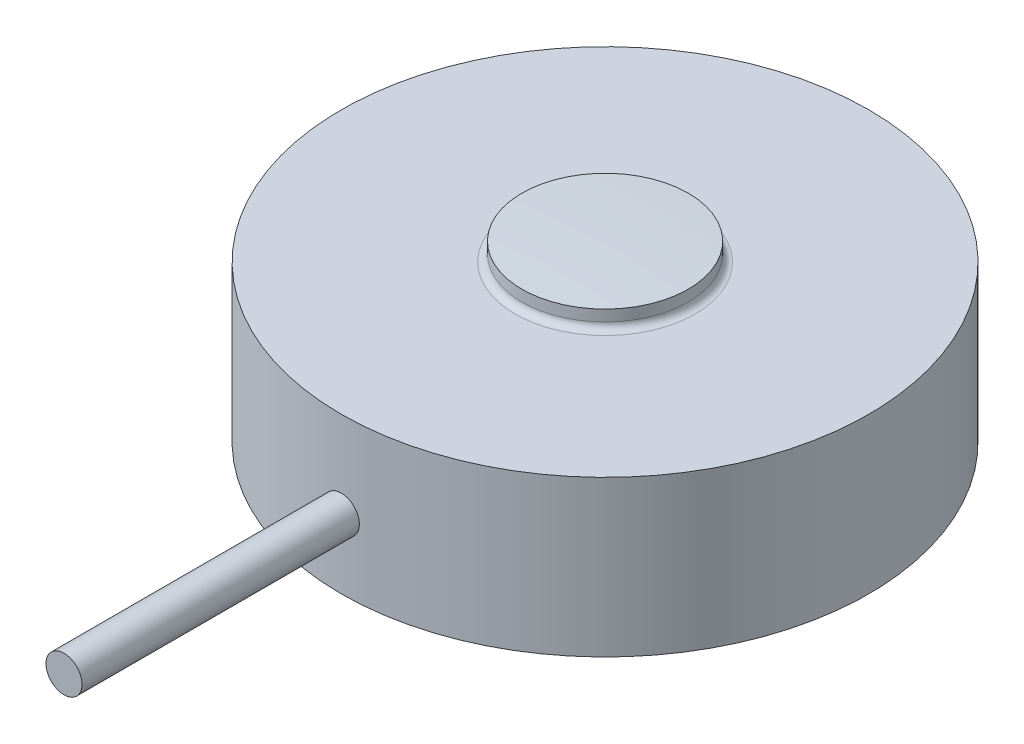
from build123d import *

# Parameters (mm, degrees)
SKETCH6_R          = 8.36
CUT_EXTRUDE1_DEPTH = 0.8
SKETCH4_W          = 10
SKETCH4_H          = 0.65
FILLET4_R          = 0.25


with BuildPart() as part:
    # Sketch2 → Revolve1 (revolve)
    with BuildSketch(Plane(origin=(0, 0, 0), x_dir=(0, 0, -1), z_dir=(1, 0, 0)), mode=Mode.PRIVATE) as revolve1_sk:
        with BuildLine():
            Line((-3, 2.805), (-3, 3.455812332))
            ThreePointArc((-3, 3.455812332), (-1.500662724, 3.522698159), (0, 3.545))
            Line((0, 3.545), (0, 2.805))
            Line((0, 2.805), (0, -2.805))
            Line((0, -2.805), (-9.51, -2.805))
            Line((-9.51, -2.805), (-9.51, 2.805))
            Line((-9.51, 2.805), (-3, 2.805))
        make_face()
    revolve(revolve1_sk.sketch.rotate(Axis((0, -50, 0), (0, 1, 0)), 180), axis=Axis((0, -50, 0), (0, 1, 0)))

    # Sketch6 → Cut-Extrude1 (cut)
    with BuildSketch(Plane.XZ.offset(2.805)):
        with Locations(Location((0, 0, 0), (0, 0, 270))):
            Circle(SKETCH6_R)
    extrude(amount=-CUT_EXTRUDE1_DEPTH, mode=Mode.SUBTRACT)

    # Fillet4
    fillet4_edges = [part.edges().sort_by_distance(p)[0] for p in [
        (0, 2.805, 3),
    ]]
    fillet(fillet4_edges, radius=FILLET4_R)


with BuildPart() as body_2:
    # Sketch4 → Revolve6 (revolve)
    with BuildSketch(Plane(origin=(0, 0, 0), x_dir=(0, 0, -1), z_dir=(1, 0, 0)), mode=Mode.PRIVATE) as revolve6_sk:
        with Locations((-14.51, 0.02)):
            Rectangle(SKETCH4_W, SKETCH4_H)
    revolve(revolve6_sk.sketch.rotate(Axis((0, -0.305, 9.51), (0, 0, -1)), 90), axis=Axis((0, -0.305, 9.51), (0, 0, -1)))


solid = Compound([part.part, body_2.part])
